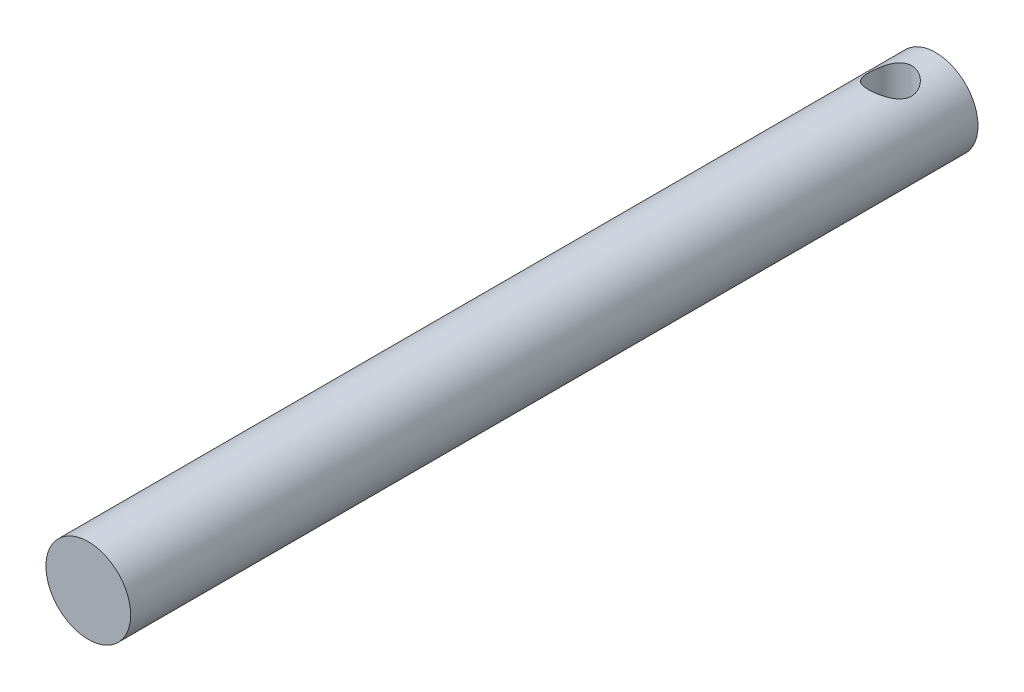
from build123d import *

# Parameters (mm, degrees)
SKETCH1_R           = 10
BOSS_EXTRUDE1_DEPTH = 200
SKETCH2_R           = 5
CUT_EXTRUDE1_DEPTH  = 100


with BuildPart() as part:
    # Sketch1 → Boss-Extrude1 (new body)
    with BuildSketch(Plane.XY):
        with Locations((0.448059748, 0.512871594)):
            Circle(SKETCH1_R)
    extrude(amount=BOSS_EXTRUDE1_DEPTH)

    # Sketch2 → Cut-Extrude1 (cut, symmetric)
    with BuildSketch(Plane(origin=(0, 0, 0), x_dir=(1, 0, 0), z_dir=(0, 1, 0))):
        with Locations(Location((0.290429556, -10.523713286, 0), (0, 0, 270))):
            Circle(SKETCH2_R)
    extrude(amount=CUT_EXTRUDE1_DEPTH, both=True, mode=Mode.SUBTRACT)


solid = part.part
